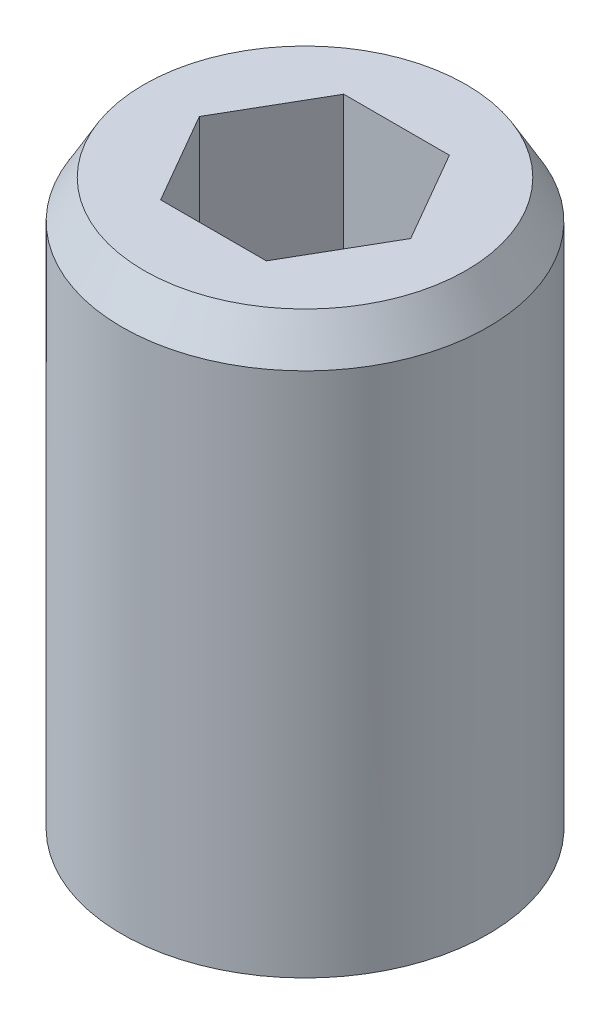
ISO-10303-21;
HEADER;
FILE_DESCRIPTION(('STEP AP214'),'2;1');
FILE_NAME('part.step','',(''),(''),'','','');
FILE_SCHEMA(('AUTOMOTIVE_DESIGN { 1 0 10303 214 1 1 1 1 }'));
ENDSEC;
DATA;
#1=APPLICATION_CONTEXT('core data for automotive mechanical design processes');
#2=APPLICATION_PROTOCOL_DEFINITION('international standard','automotive_design',2000,#1);
#3=PRODUCT_CONTEXT('',#1,'mechanical');
#4=PRODUCT('Part','Part','',(#3));
#5=PRODUCT_RELATED_PRODUCT_CATEGORY('part','',(#4));
#6=PRODUCT_DEFINITION_FORMATION('','',#4);
#7=PRODUCT_DEFINITION_CONTEXT('part definition',#1,'design');
#8=PRODUCT_DEFINITION('design','',#6,#7);
#9=PRODUCT_DEFINITION_SHAPE('','',#8);
#10=(LENGTH_UNIT() NAMED_UNIT(*) SI_UNIT(.MILLI.,.METRE.));
#11=(NAMED_UNIT(*) PLANE_ANGLE_UNIT() SI_UNIT($,.RADIAN.));
#12=(NAMED_UNIT(*) SI_UNIT($,.STERADIAN.) SOLID_ANGLE_UNIT());
#13=UNCERTAINTY_MEASURE_WITH_UNIT(LENGTH_MEASURE(1.E-05),#10,'distance_accuracy_value','');
#14=(GEOMETRIC_REPRESENTATION_CONTEXT(3) GLOBAL_UNCERTAINTY_ASSIGNED_CONTEXT((#13)) GLOBAL_UNIT_ASSIGNED_CONTEXT((#10,
#11,#12)) REPRESENTATION_CONTEXT('',''));
#15=CARTESIAN_POINT('',(0.,0.,0.));
#16=DIRECTION('',(0.,0.,1.));
#17=DIRECTION('',(1.,0.,0.));
#18=AXIS2_PLACEMENT_3D('',#15,#16,#17);
#19=CARTESIAN_POINT('',(0.,0.,0.));
#20=DIRECTION('',(0.,-1.,0.));
#21=DIRECTION('',(0.,0.,-1.));
#22=AXIS2_PLACEMENT_3D('',#19,#20,#21);
#23=PLANE('',#22);
#24=CARTESIAN_POINT('',(0.,0.,0.));
#25=DIRECTION('',(0.,-1.,0.));
#26=DIRECTION('',(0.,0.,-1.));
#27=AXIS2_PLACEMENT_3D('',#24,#25,#26);
#28=CIRCLE('',#27,1.98038475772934);
#29=CARTESIAN_POINT('',(0.,0.,-1.98038475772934));
#30=VERTEX_POINT('',#29);
#31=EDGE_CURVE('E11',#30,#30,#28,.T.);
#32=ORIENTED_EDGE('',*,*,#31,.T.);
#33=EDGE_LOOP('',(#32));
#34=FACE_BOUND('',#33,.T.);
#35=ADVANCED_FACE('F38',(#34),#23,.T.);
#36=CARTESIAN_POINT('',(0.,0.,0.));
#37=DIRECTION('',(0.,-1.,0.));
#38=DIRECTION('',(0.,0.,-1.));
#39=AXIS2_PLACEMENT_3D('',#36,#37,#38);
#40=CYLINDRICAL_SURFACE('',#39,2.5);
#41=CARTESIAN_POINT('',(0.,7.48038475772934,0.));
#42=DIRECTION('',(0.,1.,0.));
#43=DIRECTION('',(0.,0.,1.));
#44=AXIS2_PLACEMENT_3D('',#41,#42,#43);
#45=CIRCLE('',#44,2.5);
#46=CARTESIAN_POINT('',(0.,7.48038475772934,2.5));
#47=VERTEX_POINT('',#46);
#48=EDGE_CURVE('E149',#47,#47,#45,.F.);
#49=ORIENTED_EDGE('',*,*,#48,.T.);
#50=EDGE_LOOP('',(#49));
#51=FACE_BOUND('',#50,.T.);
#52=CARTESIAN_POINT('',(0.,0.3,0.));
#53=DIRECTION('',(0.,-1.,0.));
#54=DIRECTION('',(0.,0.,-1.));
#55=AXIS2_PLACEMENT_3D('',#52,#53,#54);
#56=CIRCLE('',#55,2.5);
#57=CARTESIAN_POINT('',(0.,0.3,-2.5));
#58=VERTEX_POINT('',#57);
#59=EDGE_CURVE('E140',#58,#58,#56,.F.);
#60=ORIENTED_EDGE('',*,*,#59,.T.);
#61=EDGE_LOOP('',(#60));
#62=FACE_BOUND('',#61,.T.);
#63=ADVANCED_FACE('F161',(#51,#62),#40,.T.);
#64=CARTESIAN_POINT('',(2.5,8.,0.));
#65=DIRECTION('',(0.,1.,0.));
#66=DIRECTION('',(0.,0.,1.));
#67=AXIS2_PLACEMENT_3D('',#64,#65,#66);
#68=PLANE('',#67);
#69=DIRECTION('',(-1.,0.,0.));
#70=VECTOR('',#69,1.);
#71=CARTESIAN_POINT('',(0.721687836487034,8.,-1.25));
#72=LINE('',#71,#70);
#73=CARTESIAN_POINT('',(0.721687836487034,8.,-1.25));
#74=VERTEX_POINT('',#73);
#75=CARTESIAN_POINT('',(-0.721687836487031,8.,-1.25));
#76=VERTEX_POINT('',#75);
#77=EDGE_CURVE('E52',#74,#76,#72,.T.);
#78=ORIENTED_EDGE('',*,*,#77,.F.);
#79=DIRECTION('',(-0.5,0.,-0.866025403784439));
#80=VECTOR('',#79,1.);
#81=CARTESIAN_POINT('',(1.44337567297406,8.,0.));
#82=LINE('',#81,#80);
#83=CARTESIAN_POINT('',(1.44337567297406,8.,0.));
#84=VERTEX_POINT('',#83);
#85=EDGE_CURVE('E122',#84,#74,#82,.T.);
#86=ORIENTED_EDGE('',*,*,#85,.F.);
#87=DIRECTION('',(0.5,0.,-0.866025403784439));
#88=VECTOR('',#87,1.);
#89=CARTESIAN_POINT('',(0.721687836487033,8.,1.25));
#90=LINE('',#89,#88);
#91=CARTESIAN_POINT('',(0.721687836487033,8.,1.25));
#92=VERTEX_POINT('',#91);
#93=EDGE_CURVE('E116',#92,#84,#90,.T.);
#94=ORIENTED_EDGE('',*,*,#93,.F.);
#95=DIRECTION('',(1.,0.,0.));
#96=VECTOR('',#95,1.);
#97=CARTESIAN_POINT('',(-0.721687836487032,8.,1.25));
#98=LINE('',#97,#96);
#99=CARTESIAN_POINT('',(-0.721687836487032,8.,1.25));
#100=VERTEX_POINT('',#99);
#101=EDGE_CURVE('E114',#100,#92,#98,.T.);
#102=ORIENTED_EDGE('',*,*,#101,.F.);
#103=DIRECTION('',(0.5,0.,0.866025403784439));
#104=VECTOR('',#103,1.);
#105=CARTESIAN_POINT('',(-1.44337567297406,8.,0.));
#106=LINE('',#105,#104);
#107=CARTESIAN_POINT('',(-1.44337567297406,8.,0.));
#108=VERTEX_POINT('',#107);
#109=EDGE_CURVE('E95',#108,#100,#106,.T.);
#110=ORIENTED_EDGE('',*,*,#109,.F.);
#111=DIRECTION('',(-0.5,0.,0.866025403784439));
#112=VECTOR('',#111,1.);
#113=CARTESIAN_POINT('',(-0.721687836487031,8.,-1.25));
#114=LINE('',#113,#112);
#115=EDGE_CURVE('E106',#76,#108,#114,.T.);
#116=ORIENTED_EDGE('',*,*,#115,.F.);
#117=EDGE_LOOP('',(#78,#86,#94,#102,#110,#116));
#118=FACE_BOUND('',#117,.T.);
#119=CARTESIAN_POINT('',(0.,8.,0.));
#120=DIRECTION('',(0.,1.,0.));
#121=DIRECTION('',(0.,0.,1.));
#122=AXIS2_PLACEMENT_3D('',#119,#120,#121);
#123=CIRCLE('',#122,2.2);
#124=CARTESIAN_POINT('',(0.,8.,2.2));
#125=VERTEX_POINT('',#124);
#126=EDGE_CURVE('E45',#125,#125,#123,.T.);
#127=ORIENTED_EDGE('',*,*,#126,.T.);
#128=EDGE_LOOP('',(#127));
#129=FACE_BOUND('',#128,.T.);
#130=ADVANCED_FACE('F110',(#118,#129),#68,.T.);
#131=CARTESIAN_POINT('',(0.,7.48038475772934,0.));
#132=DIRECTION('',(0.,-1.,0.));
#133=DIRECTION('',(0.,0.,-1.));
#134=AXIS2_PLACEMENT_3D('',#131,#132,#133);
#135=CONICAL_SURFACE('',#134,2.5,0.523598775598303);
#136=ORIENTED_EDGE('',*,*,#126,.F.);
#137=EDGE_LOOP('',(#136));
#138=FACE_BOUND('',#137,.T.);
#139=ORIENTED_EDGE('',*,*,#48,.F.);
#140=EDGE_LOOP('',(#139));
#141=FACE_BOUND('',#140,.T.);
#142=ADVANCED_FACE('F154',(#138,#141),#135,.T.);
#143=CARTESIAN_POINT('',(0.,0.,0.));
#144=DIRECTION('',(0.,1.,0.));
#145=DIRECTION('',(0.,0.,1.));
#146=AXIS2_PLACEMENT_3D('',#143,#144,#145);
#147=CONICAL_SURFACE('',#146,1.98038475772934,1.0471975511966);
#148=ORIENTED_EDGE('',*,*,#59,.F.);
#149=EDGE_LOOP('',(#148));
#150=FACE_BOUND('',#149,.T.);
#151=ORIENTED_EDGE('',*,*,#31,.F.);
#152=EDGE_LOOP('',(#151));
#153=FACE_BOUND('',#152,.T.);
#154=ADVANCED_FACE('F157',(#150,#153),#147,.T.);
#155=CARTESIAN_POINT('',(0.721687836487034,5.5,-1.25));
#156=DIRECTION('',(0.,0.,-1.));
#157=DIRECTION('',(-1.,0.,0.));
#158=AXIS2_PLACEMENT_3D('',#155,#156,#157);
#159=PLANE('',#158);
#160=ORIENTED_EDGE('',*,*,#77,.T.);
#161=DIRECTION('',(0.,1.,0.));
#162=VECTOR('',#161,1.);
#163=CARTESIAN_POINT('',(-0.721687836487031,5.5,-1.25));
#164=LINE('',#163,#162);
#165=CARTESIAN_POINT('',(-0.721687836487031,5.5,-1.25));
#166=VERTEX_POINT('',#165);
#167=EDGE_CURVE('E103',#166,#76,#164,.T.);
#168=ORIENTED_EDGE('',*,*,#167,.F.);
#169=DIRECTION('',(-1.,0.,0.));
#170=VECTOR('',#169,1.);
#171=CARTESIAN_POINT('',(0.721687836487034,5.5,-1.25));
#172=LINE('',#171,#170);
#173=CARTESIAN_POINT('',(0.721687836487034,5.5,-1.25));
#174=VERTEX_POINT('',#173);
#175=EDGE_CURVE('E124',#174,#166,#172,.T.);
#176=ORIENTED_EDGE('',*,*,#175,.F.);
#177=DIRECTION('',(0.,1.,0.));
#178=VECTOR('',#177,1.);
#179=CARTESIAN_POINT('',(0.721687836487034,5.5,-1.25));
#180=LINE('',#179,#178);
#181=EDGE_CURVE('E59',#174,#74,#180,.T.);
#182=ORIENTED_EDGE('',*,*,#181,.T.);
#183=EDGE_LOOP('',(#160,#168,#176,#182));
#184=FACE_BOUND('',#183,.T.);
#185=ADVANCED_FACE('F168',(#184),#159,.F.);
#186=CARTESIAN_POINT('',(1.44337567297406,5.5,0.));
#187=DIRECTION('',(0.866025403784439,0.,-0.5));
#188=DIRECTION('',(-0.5,0.,-0.866025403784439));
#189=AXIS2_PLACEMENT_3D('',#186,#187,#188);
#190=PLANE('',#189);
#191=ORIENTED_EDGE('',*,*,#85,.T.);
#192=ORIENTED_EDGE('',*,*,#181,.F.);
#193=DIRECTION('',(-0.5,0.,-0.866025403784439));
#194=VECTOR('',#193,1.);
#195=CARTESIAN_POINT('',(1.44337567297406,5.5,0.));
#196=LINE('',#195,#194);
#197=CARTESIAN_POINT('',(1.44337567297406,5.5,0.));
#198=VERTEX_POINT('',#197);
#199=EDGE_CURVE('E136',#198,#174,#196,.T.);
#200=ORIENTED_EDGE('',*,*,#199,.F.);
#201=DIRECTION('',(0.,1.,0.));
#202=VECTOR('',#201,1.);
#203=CARTESIAN_POINT('',(1.44337567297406,5.5,0.));
#204=LINE('',#203,#202);
#205=EDGE_CURVE('E141',#198,#84,#204,.T.);
#206=ORIENTED_EDGE('',*,*,#205,.T.);
#207=EDGE_LOOP('',(#191,#192,#200,#206));
#208=FACE_BOUND('',#207,.T.);
#209=ADVANCED_FACE('F199',(#208),#190,.F.);
#210=CARTESIAN_POINT('',(0.721687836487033,5.5,1.25));
#211=DIRECTION('',(0.866025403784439,0.,0.5));
#212=DIRECTION('',(0.5,0.,-0.866025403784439));
#213=AXIS2_PLACEMENT_3D('',#210,#211,#212);
#214=PLANE('',#213);
#215=ORIENTED_EDGE('',*,*,#93,.T.);
#216=ORIENTED_EDGE('',*,*,#205,.F.);
#217=DIRECTION('',(0.5,0.,-0.866025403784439));
#218=VECTOR('',#217,1.);
#219=CARTESIAN_POINT('',(0.721687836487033,5.5,1.25));
#220=LINE('',#219,#218);
#221=CARTESIAN_POINT('',(0.721687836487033,5.5,1.25));
#222=VERTEX_POINT('',#221);
#223=EDGE_CURVE('E133',#222,#198,#220,.T.);
#224=ORIENTED_EDGE('',*,*,#223,.F.);
#225=DIRECTION('',(0.,1.,0.));
#226=VECTOR('',#225,1.);
#227=CARTESIAN_POINT('',(0.721687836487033,5.5,1.25));
#228=LINE('',#227,#226);
#229=EDGE_CURVE('E143',#222,#92,#228,.T.);
#230=ORIENTED_EDGE('',*,*,#229,.T.);
#231=EDGE_LOOP('',(#215,#216,#224,#230));
#232=FACE_BOUND('',#231,.T.);
#233=ADVANCED_FACE('F206',(#232),#214,.F.);
#234=CARTESIAN_POINT('',(-0.721687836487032,5.5,1.25));
#235=DIRECTION('',(0.,0.,1.));
#236=DIRECTION('',(1.,0.,0.));
#237=AXIS2_PLACEMENT_3D('',#234,#235,#236);
#238=PLANE('',#237);
#239=ORIENTED_EDGE('',*,*,#101,.T.);
#240=ORIENTED_EDGE('',*,*,#229,.F.);
#241=DIRECTION('',(1.,0.,0.));
#242=VECTOR('',#241,1.);
#243=CARTESIAN_POINT('',(-0.721687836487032,5.5,1.25));
#244=LINE('',#243,#242);
#245=CARTESIAN_POINT('',(-0.721687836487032,5.5,1.25));
#246=VERTEX_POINT('',#245);
#247=EDGE_CURVE('E130',#246,#222,#244,.T.);
#248=ORIENTED_EDGE('',*,*,#247,.F.);
#249=DIRECTION('',(0.,1.,0.));
#250=VECTOR('',#249,1.);
#251=CARTESIAN_POINT('',(-0.721687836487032,5.5,1.25));
#252=LINE('',#251,#250);
#253=EDGE_CURVE('E102',#246,#100,#252,.T.);
#254=ORIENTED_EDGE('',*,*,#253,.T.);
#255=EDGE_LOOP('',(#239,#240,#248,#254));
#256=FACE_BOUND('',#255,.T.);
#257=ADVANCED_FACE('F213',(#256),#238,.F.);
#258=CARTESIAN_POINT('',(-1.44337567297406,5.5,0.));
#259=DIRECTION('',(-0.866025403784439,0.,0.5));
#260=DIRECTION('',(0.5,0.,0.866025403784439));
#261=AXIS2_PLACEMENT_3D('',#258,#259,#260);
#262=PLANE('',#261);
#263=ORIENTED_EDGE('',*,*,#109,.T.);
#264=ORIENTED_EDGE('',*,*,#253,.F.);
#265=DIRECTION('',(0.5,0.,0.866025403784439));
#266=VECTOR('',#265,1.);
#267=CARTESIAN_POINT('',(-1.44337567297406,5.5,0.));
#268=LINE('',#267,#266);
#269=CARTESIAN_POINT('',(-1.44337567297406,5.5,0.));
#270=VERTEX_POINT('',#269);
#271=EDGE_CURVE('E98',#270,#246,#268,.T.);
#272=ORIENTED_EDGE('',*,*,#271,.F.);
#273=DIRECTION('',(0.,1.,0.));
#274=VECTOR('',#273,1.);
#275=CARTESIAN_POINT('',(-1.44337567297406,5.5,0.));
#276=LINE('',#275,#274);
#277=EDGE_CURVE('E91',#270,#108,#276,.T.);
#278=ORIENTED_EDGE('',*,*,#277,.T.);
#279=EDGE_LOOP('',(#263,#264,#272,#278));
#280=FACE_BOUND('',#279,.T.);
#281=ADVANCED_FACE('F93',(#280),#262,.F.);
#282=CARTESIAN_POINT('',(-0.721687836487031,5.5,-1.25));
#283=DIRECTION('',(-0.866025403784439,0.,-0.5));
#284=DIRECTION('',(-0.5,0.,0.866025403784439));
#285=AXIS2_PLACEMENT_3D('',#282,#283,#284);
#286=PLANE('',#285);
#287=ORIENTED_EDGE('',*,*,#115,.T.);
#288=ORIENTED_EDGE('',*,*,#277,.F.);
#289=DIRECTION('',(-0.5,0.,0.866025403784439));
#290=VECTOR('',#289,1.);
#291=CARTESIAN_POINT('',(-0.721687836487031,5.5,-1.25));
#292=LINE('',#291,#290);
#293=EDGE_CURVE('E127',#166,#270,#292,.T.);
#294=ORIENTED_EDGE('',*,*,#293,.F.);
#295=ORIENTED_EDGE('',*,*,#167,.T.);
#296=EDGE_LOOP('',(#287,#288,#294,#295));
#297=FACE_BOUND('',#296,.T.);
#298=ADVANCED_FACE('F107',(#297),#286,.F.);
#299=CARTESIAN_POINT('',(2.1650635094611,5.5,-1.25));
#300=DIRECTION('',(0.,-1.,0.));
#301=DIRECTION('',(0.,0.,-1.));
#302=AXIS2_PLACEMENT_3D('',#299,#300,#301);
#303=PLANE('',#302);
#304=ORIENTED_EDGE('',*,*,#175,.T.);
#305=ORIENTED_EDGE('',*,*,#293,.T.);
#306=ORIENTED_EDGE('',*,*,#271,.T.);
#307=ORIENTED_EDGE('',*,*,#247,.T.);
#308=ORIENTED_EDGE('',*,*,#223,.T.);
#309=ORIENTED_EDGE('',*,*,#199,.T.);
#310=EDGE_LOOP('',(#304,#305,#306,#307,#308,#309));
#311=FACE_BOUND('',#310,.T.);
#312=ADVANCED_FACE('F234',(#311),#303,.F.);
#313=CLOSED_SHELL('',(#35,#63,#130,#142,#154,#185,#209,#233,#257,#281,#298,#312));
#314=MANIFOLD_SOLID_BREP('B2',#313);
#315=ADVANCED_BREP_SHAPE_REPRESENTATION('',(#18,#314),#14);
#316=SHAPE_DEFINITION_REPRESENTATION(#9,#315);
ENDSEC;
END-ISO-10303-21;
